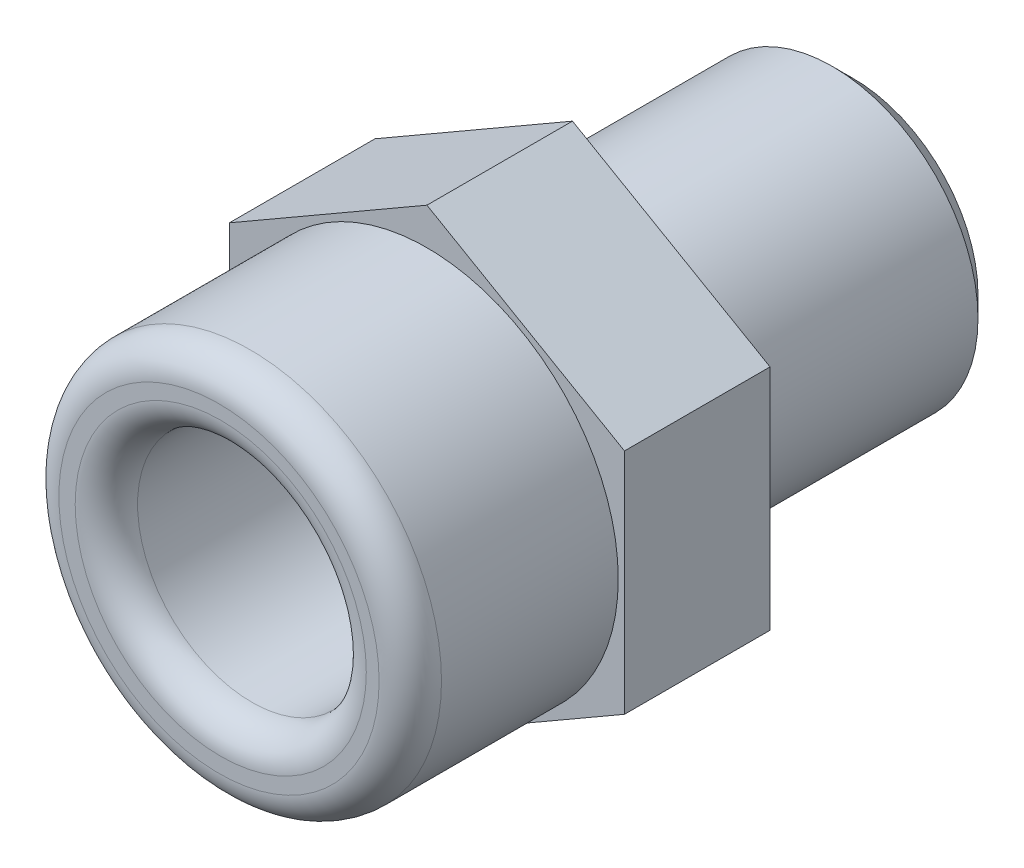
from build123d import *

# Parameters (mm, degrees)
BASE_EXTRUSION_DEPTH    = 7
ESQUISSE2_R             = 9.2
BOSS_EXTRU_1_DEPTH      = 10
ESQUISSE3_R             = 7
BOSS_EXTRU_2_DEPTH      = 13.5
CHANFREIN1_SIZE         = 1
ESQUISSE4_R             = 5.5
ENL_V_MAT_EXTRU_1_DEPTH = 12.8
ESQUISSE5_R             = 5.75
ENL_V_MAT_EXTRU_2_DEPTH = 13
ESQUISSE6_R             = 3.5
ENL_V_MAT_EXTRU_3_DEPTH = 23.733968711
CONG_1_R                = 1.5


with BuildPart() as part:
    # Esquisse1 → Base-Extrusion (new body)
    with BuildSketch(Plane.XY):
        Polygon((0, -10.969655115), (9.5, -5.484827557), (9.5, 5.484827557), (0, 10.969655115), (-9.5, 5.484827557), (-9.5, -5.484827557), align=None)
    extrude(amount=BASE_EXTRUSION_DEPTH)

    # Esquisse2 → Boss.-Extru.1 (add)
    with BuildSketch(Plane.XY.offset(7)):
        with Locations(Location((0, 0, 0), (0, 0, 180))):
            Circle(ESQUISSE2_R)
    extrude(amount=BOSS_EXTRU_1_DEPTH)

    # Esquisse3 → Boss.-Extru.2 (add)
    with BuildSketch(Plane(origin=(0, 0, 0), x_dir=(-1, 0, 0), z_dir=(0, 0, -1))):
        with Locations(Location((0, 0, 0), (0, 0, 180))):
            Circle(ESQUISSE3_R)
    extrude(amount=BOSS_EXTRU_2_DEPTH)

    # Chanfrein1
    chanfrein1_edges = [part.edges().sort_by_distance(p)[0] for p in [
        (-7, 0, -13.5),
    ]]
    chamfer(chanfrein1_edges, length=CHANFREIN1_SIZE)

    # Esquisse4 → Enl_v. mat.-Extru.1 (cut)
    with BuildSketch(Plane.XY.offset(17)):
        with Locations((0.083865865, 0.055910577)):
            Circle(ESQUISSE4_R)
    extrude(amount=-ENL_V_MAT_EXTRU_1_DEPTH, mode=Mode.SUBTRACT)

    # Esquisse5 → Enl_v. mat.-Extru.2 (cut)
    with BuildSketch(Plane(origin=(0, 0, -13.5), x_dir=(-1, 0, 0), z_dir=(0, 0, -1))):
        Circle(ESQUISSE5_R)
    extrude(amount=-ENL_V_MAT_EXTRU_2_DEPTH, mode=Mode.SUBTRACT)

    # Esquisse6 → Enl_v. mat.-Extru.3 (cut, through all)
    with BuildSketch(Plane(origin=(0, 0, -0.5), x_dir=(-1, 0, 0), z_dir=(0, 0, -1))):
        Circle(ESQUISSE6_R)
    extrude(amount=-ENL_V_MAT_EXTRU_3_DEPTH, mode=Mode.SUBTRACT)

    # Cong_1
    cong_1_edges = [part.edges().sort_by_distance(p)[0] for p in [
        (9.2, 0, 17),
        (-5.416134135, 0.055910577, 17),
    ]]
    fillet(cong_1_edges, radius=CONG_1_R)


solid = part.part
